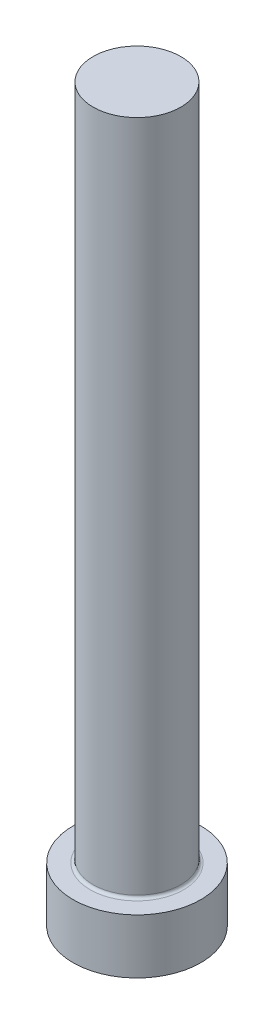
ISO-10303-21;
HEADER;
FILE_DESCRIPTION(('STEP AP214'),'2;1');
FILE_NAME('part.step','',(''),(''),'','','');
FILE_SCHEMA(('AUTOMOTIVE_DESIGN { 1 0 10303 214 1 1 1 1 }'));
ENDSEC;
DATA;
#1=APPLICATION_CONTEXT('core data for automotive mechanical design processes');
#2=APPLICATION_PROTOCOL_DEFINITION('international standard','automotive_design',2000,#1);
#3=PRODUCT_CONTEXT('',#1,'mechanical');
#4=PRODUCT('Part','Part','',(#3));
#5=PRODUCT_RELATED_PRODUCT_CATEGORY('part','',(#4));
#6=PRODUCT_DEFINITION_FORMATION('','',#4);
#7=PRODUCT_DEFINITION_CONTEXT('part definition',#1,'design');
#8=PRODUCT_DEFINITION('design','',#6,#7);
#9=PRODUCT_DEFINITION_SHAPE('','',#8);
#10=(LENGTH_UNIT() NAMED_UNIT(*) SI_UNIT(.MILLI.,.METRE.));
#11=(NAMED_UNIT(*) PLANE_ANGLE_UNIT() SI_UNIT($,.RADIAN.));
#12=(NAMED_UNIT(*) SI_UNIT($,.STERADIAN.) SOLID_ANGLE_UNIT());
#13=UNCERTAINTY_MEASURE_WITH_UNIT(LENGTH_MEASURE(1.E-05),#10,'distance_accuracy_value','');
#14=(GEOMETRIC_REPRESENTATION_CONTEXT(3) GLOBAL_UNCERTAINTY_ASSIGNED_CONTEXT((#13)) GLOBAL_UNIT_ASSIGNED_CONTEXT((#10,
#11,#12)) REPRESENTATION_CONTEXT('',''));
#15=CARTESIAN_POINT('',(0.,0.,0.));
#16=DIRECTION('',(0.,0.,1.));
#17=DIRECTION('',(1.,0.,0.));
#18=AXIS2_PLACEMENT_3D('',#15,#16,#17);
#19=CARTESIAN_POINT('',(0.,63.5,0.));
#20=DIRECTION('',(0.,-1.,0.));
#21=DIRECTION('',(0.,0.,-1.));
#22=AXIS2_PLACEMENT_3D('',#19,#20,#21);
#23=PLANE('',#22);
#24=CARTESIAN_POINT('',(0.,63.5,0.));
#25=DIRECTION('',(0.,1.,0.));
#26=DIRECTION('',(0.,0.,1.));
#27=AXIS2_PLACEMENT_3D('',#24,#25,#26);
#28=CIRCLE('',#27,3.81);
#29=CARTESIAN_POINT('',(0.,63.5,3.81));
#30=VERTEX_POINT('',#29);
#31=EDGE_CURVE('E10',#30,#30,#28,.T.);
#32=ORIENTED_EDGE('',*,*,#31,.T.);
#33=EDGE_LOOP('',(#32));
#34=FACE_BOUND('',#33,.T.);
#35=ADVANCED_FACE('F30',(#34),#23,.F.);
#36=CARTESIAN_POINT('',(0.,0.,0.));
#37=DIRECTION('',(0.,1.,0.));
#38=DIRECTION('',(0.,0.,1.));
#39=AXIS2_PLACEMENT_3D('',#36,#37,#38);
#40=CYLINDRICAL_SURFACE('',#39,3.81);
#41=ORIENTED_EDGE('',*,*,#31,.F.);
#42=EDGE_LOOP('',(#41));
#43=FACE_BOUND('',#42,.T.);
#44=CARTESIAN_POINT('',(0.,5.0038,0.));
#45=DIRECTION('',(0.,1.,0.));
#46=DIRECTION('',(0.,0.,1.));
#47=AXIS2_PLACEMENT_3D('',#44,#45,#46);
#48=CIRCLE('',#47,3.81);
#49=CARTESIAN_POINT('',(0.,5.0038,3.81));
#50=VERTEX_POINT('',#49);
#51=EDGE_CURVE('E36',#50,#50,#48,.T.);
#52=ORIENTED_EDGE('',*,*,#51,.T.);
#53=EDGE_LOOP('',(#52));
#54=FACE_BOUND('',#53,.T.);
#55=ADVANCED_FACE('F65',(#43,#54),#40,.T.);
#56=CARTESIAN_POINT('',(0.,5.0038,0.));
#57=DIRECTION('',(0.,1.,0.));
#58=DIRECTION('',(0.,0.,1.));
#59=AXIS2_PLACEMENT_3D('',#56,#57,#58);
#60=TOROIDAL_SURFACE('',#59,4.064,0.254);
#61=ORIENTED_EDGE('',*,*,#51,.F.);
#62=EDGE_LOOP('',(#61));
#63=FACE_BOUND('',#62,.T.);
#64=CARTESIAN_POINT('',(0.,4.7498,0.));
#65=DIRECTION('',(0.,1.,0.));
#66=DIRECTION('',(0.,0.,1.));
#67=AXIS2_PLACEMENT_3D('',#64,#65,#66);
#68=CIRCLE('',#67,4.064);
#69=CARTESIAN_POINT('',(0.,4.7498,4.064));
#70=VERTEX_POINT('',#69);
#71=EDGE_CURVE('E40',#70,#70,#68,.T.);
#72=ORIENTED_EDGE('',*,*,#71,.T.);
#73=EDGE_LOOP('',(#72));
#74=FACE_BOUND('',#73,.T.);
#75=ADVANCED_FACE('F69',(#63,#74),#60,.F.);
#76=CARTESIAN_POINT('',(5.5499,4.7498,0.));
#77=DIRECTION('',(0.,-1.,0.));
#78=DIRECTION('',(0.,0.,-1.));
#79=AXIS2_PLACEMENT_3D('',#76,#77,#78);
#80=PLANE('',#79);
#81=ORIENTED_EDGE('',*,*,#71,.F.);
#82=EDGE_LOOP('',(#81));
#83=FACE_BOUND('',#82,.T.);
#84=CARTESIAN_POINT('',(0.,4.7498,0.));
#85=DIRECTION('',(0.,1.,0.));
#86=DIRECTION('',(0.,0.,1.));
#87=AXIS2_PLACEMENT_3D('',#84,#85,#86);
#88=CIRCLE('',#87,5.5499);
#89=CARTESIAN_POINT('',(0.,4.7498,5.5499));
#90=VERTEX_POINT('',#89);
#91=EDGE_CURVE('E44',#90,#90,#88,.T.);
#92=ORIENTED_EDGE('',*,*,#91,.T.);
#93=EDGE_LOOP('',(#92));
#94=FACE_BOUND('',#93,.T.);
#95=ADVANCED_FACE('F61',(#83,#94),#80,.F.);
#96=CARTESIAN_POINT('',(0.,0.,0.));
#97=DIRECTION('',(0.,1.,0.));
#98=DIRECTION('',(0.,0.,1.));
#99=AXIS2_PLACEMENT_3D('',#96,#97,#98);
#100=CYLINDRICAL_SURFACE('',#99,5.5499);
#101=ORIENTED_EDGE('',*,*,#91,.F.);
#102=EDGE_LOOP('',(#101));
#103=FACE_BOUND('',#102,.T.);
#104=CARTESIAN_POINT('',(0.,0.,0.));
#105=DIRECTION('',(0.,1.,0.));
#106=DIRECTION('',(0.,0.,1.));
#107=AXIS2_PLACEMENT_3D('',#104,#105,#106);
#108=CIRCLE('',#107,5.5499);
#109=CARTESIAN_POINT('',(0.,0.,5.5499));
#110=VERTEX_POINT('',#109);
#111=EDGE_CURVE('E49',#110,#110,#108,.T.);
#112=ORIENTED_EDGE('',*,*,#111,.T.);
#113=EDGE_LOOP('',(#112));
#114=FACE_BOUND('',#113,.T.);
#115=ADVANCED_FACE('F53',(#103,#114),#100,.T.);
#116=CARTESIAN_POINT('',(0.,0.,0.));
#117=DIRECTION('',(0.,1.,0.));
#118=DIRECTION('',(0.,0.,1.));
#119=AXIS2_PLACEMENT_3D('',#116,#117,#118);
#120=PLANE('',#119);
#121=ORIENTED_EDGE('',*,*,#111,.F.);
#122=EDGE_LOOP('',(#121));
#123=FACE_BOUND('',#122,.T.);
#124=ADVANCED_FACE('F55',(#123),#120,.F.);
#125=CLOSED_SHELL('',(#35,#55,#75,#95,#115,#124));
#126=MANIFOLD_SOLID_BREP('B2',#125);
#127=ADVANCED_BREP_SHAPE_REPRESENTATION('',(#18,#126),#14);
#128=SHAPE_DEFINITION_REPRESENTATION(#9,#127);
ENDSEC;
END-ISO-10303-21;
